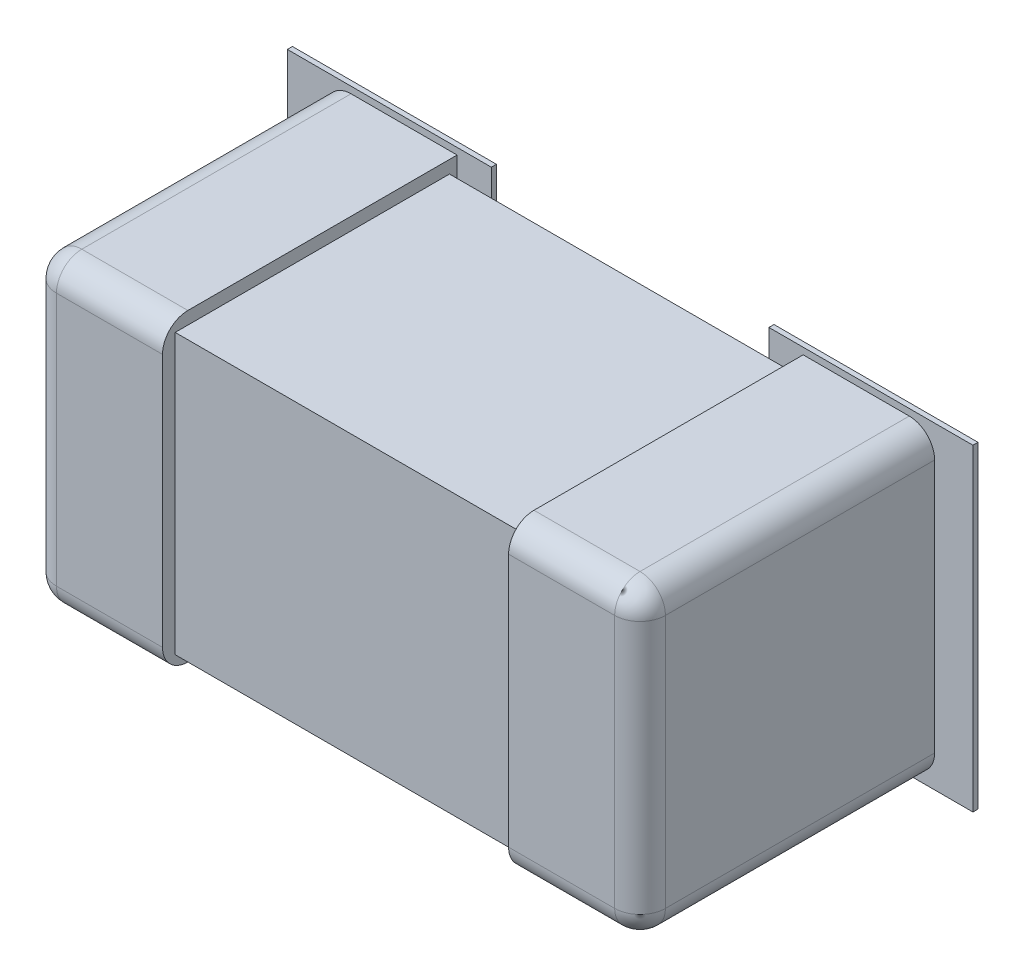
ISO-10303-21;
HEADER;
FILE_DESCRIPTION(('STEP AP214'),'2;1');
FILE_NAME('part.step','',(''),(''),'','','');
FILE_SCHEMA(('AUTOMOTIVE_DESIGN { 1 0 10303 214 1 1 1 1 }'));
ENDSEC;
DATA;
#1=APPLICATION_CONTEXT('core data for automotive mechanical design processes');
#2=APPLICATION_PROTOCOL_DEFINITION('international standard','automotive_design',2000,#1);
#3=PRODUCT_CONTEXT('',#1,'mechanical');
#4=PRODUCT('Part','Part','',(#3));
#5=PRODUCT_RELATED_PRODUCT_CATEGORY('part','',(#4));
#6=PRODUCT_DEFINITION_FORMATION('','',#4);
#7=PRODUCT_DEFINITION_CONTEXT('part definition',#1,'design');
#8=PRODUCT_DEFINITION('design','',#6,#7);
#9=PRODUCT_DEFINITION_SHAPE('','',#8);
#10=(LENGTH_UNIT() NAMED_UNIT(*) SI_UNIT(.MILLI.,.METRE.));
#11=(NAMED_UNIT(*) PLANE_ANGLE_UNIT() SI_UNIT($,.RADIAN.));
#12=(NAMED_UNIT(*) SI_UNIT($,.STERADIAN.) SOLID_ANGLE_UNIT());
#13=UNCERTAINTY_MEASURE_WITH_UNIT(LENGTH_MEASURE(1.E-05),#10,'distance_accuracy_value','');
#14=(GEOMETRIC_REPRESENTATION_CONTEXT(3) GLOBAL_UNCERTAINTY_ASSIGNED_CONTEXT((#13)) GLOBAL_UNIT_ASSIGNED_CONTEXT((#10,
#11,#12)) REPRESENTATION_CONTEXT('',''));
#15=CARTESIAN_POINT('',(0.,0.,0.));
#16=DIRECTION('',(0.,0.,1.));
#17=DIRECTION('',(1.,0.,0.));
#18=AXIS2_PLACEMENT_3D('',#15,#16,#17);
#19=CARTESIAN_POINT('',(0.,0.,0.0762));
#20=DIRECTION('',(0.,0.,1.));
#21=DIRECTION('',(1.,0.,0.));
#22=AXIS2_PLACEMENT_3D('',#19,#20,#21);
#23=PLANE('',#22);
#24=DIRECTION('',(1.,0.,0.));
#25=VECTOR('',#24,1.);
#26=CARTESIAN_POINT('',(0.138938,-0.159004,0.0762));
#27=LINE('',#26,#25);
#28=CARTESIAN_POINT('',(0.138938,-0.159004,0.0762));
#29=VERTEX_POINT('',#28);
#30=CARTESIAN_POINT('',(0.343154,-0.159004,0.0762));
#31=VERTEX_POINT('',#30);
#32=EDGE_CURVE('E330',#29,#31,#27,.T.);
#33=ORIENTED_EDGE('',*,*,#32,.F.);
#34=DIRECTION('',(0.,1.,0.));
#35=VECTOR('',#34,1.);
#36=CARTESIAN_POINT('',(0.138938,0.159004,0.0762));
#37=LINE('',#36,#35);
#38=CARTESIAN_POINT('',(0.138938,0.159004,0.0762));
#39=VERTEX_POINT('',#38);
#40=EDGE_CURVE('E335',#39,#29,#37,.F.);
#41=ORIENTED_EDGE('',*,*,#40,.F.);
#42=DIRECTION('',(1.,0.,0.));
#43=VECTOR('',#42,1.);
#44=CARTESIAN_POINT('',(0.343154,0.159004,0.0762));
#45=LINE('',#44,#43);
#46=CARTESIAN_POINT('',(0.343154,0.159004,0.0762));
#47=VERTEX_POINT('',#46);
#48=EDGE_CURVE('E319',#47,#39,#45,.F.);
#49=ORIENTED_EDGE('',*,*,#48,.F.);
#50=DIRECTION('',(0.,1.,0.));
#51=VECTOR('',#50,1.);
#52=CARTESIAN_POINT('',(0.343154,-0.159004,0.0762));
#53=LINE('',#52,#51);
#54=EDGE_CURVE('E95',#31,#47,#53,.T.);
#55=ORIENTED_EDGE('',*,*,#54,.F.);
#56=EDGE_LOOP('',(#33,#41,#49,#55));
#57=FACE_BOUND('',#56,.T.);
#58=ADVANCED_FACE('F16',(#57),#23,.F.);
#59=CARTESIAN_POINT('',(0.,0.,0.0762));
#60=DIRECTION('',(0.,0.,1.));
#61=DIRECTION('',(1.,0.,0.));
#62=AXIS2_PLACEMENT_3D('',#59,#60,#61);
#63=PLANE('',#62);
#64=DIRECTION('',(1.,0.,0.));
#65=VECTOR('',#64,1.);
#66=CARTESIAN_POINT('',(-0.138938,0.159004,0.0762));
#67=LINE('',#66,#65);
#68=CARTESIAN_POINT('',(-0.138938,0.159004,0.0762));
#69=VERTEX_POINT('',#68);
#70=CARTESIAN_POINT('',(-0.343154,0.159004,0.0762));
#71=VERTEX_POINT('',#70);
#72=EDGE_CURVE('E278',#69,#71,#67,.F.);
#73=ORIENTED_EDGE('',*,*,#72,.F.);
#74=DIRECTION('',(0.,1.,0.));
#75=VECTOR('',#74,1.);
#76=CARTESIAN_POINT('',(-0.138938,-0.159004,0.0762));
#77=LINE('',#76,#75);
#78=CARTESIAN_POINT('',(-0.138938,-0.159004,0.0762));
#79=VERTEX_POINT('',#78);
#80=EDGE_CURVE('E284',#79,#69,#77,.T.);
#81=ORIENTED_EDGE('',*,*,#80,.F.);
#82=DIRECTION('',(1.,0.,0.));
#83=VECTOR('',#82,1.);
#84=CARTESIAN_POINT('',(-0.343154,-0.159004,0.0762));
#85=LINE('',#84,#83);
#86=CARTESIAN_POINT('',(-0.343154,-0.159004,0.0762));
#87=VERTEX_POINT('',#86);
#88=EDGE_CURVE('E263',#87,#79,#85,.T.);
#89=ORIENTED_EDGE('',*,*,#88,.F.);
#90=DIRECTION('',(0.,1.,0.));
#91=VECTOR('',#90,1.);
#92=CARTESIAN_POINT('',(-0.343154,0.159004,0.0762));
#93=LINE('',#92,#91);
#94=EDGE_CURVE('E272',#71,#87,#93,.F.);
#95=ORIENTED_EDGE('',*,*,#94,.F.);
#96=EDGE_LOOP('',(#73,#81,#89,#95));
#97=FACE_BOUND('',#96,.T.);
#98=ADVANCED_FACE('F657',(#97),#63,.F.);
#99=CARTESIAN_POINT('',(0.138938,0.159004,0.0762));
#100=DIRECTION('',(-1.,0.,0.));
#101=DIRECTION('',(0.,0.,1.));
#102=AXIS2_PLACEMENT_3D('',#99,#100,#101);
#103=PLANE('',#102);
#104=DIRECTION('',(0.,0.,1.));
#105=VECTOR('',#104,1.);
#106=CARTESIAN_POINT('',(0.138938,0.159004,0.0762));
#107=LINE('',#106,#105);
#108=CARTESIAN_POINT('',(0.138938,0.159004,0.08128));
#109=VERTEX_POINT('',#108);
#110=EDGE_CURVE('E324',#39,#109,#107,.T.);
#111=ORIENTED_EDGE('',*,*,#110,.F.);
#112=ORIENTED_EDGE('',*,*,#40,.T.);
#113=DIRECTION('',(0.,0.,-1.));
#114=VECTOR('',#113,1.);
#115=CARTESIAN_POINT('',(0.138938,-0.159004,0.0762));
#116=LINE('',#115,#114);
#117=CARTESIAN_POINT('',(0.138938,-0.159004,0.08128));
#118=VERTEX_POINT('',#117);
#119=EDGE_CURVE('E332',#118,#29,#116,.T.);
#120=ORIENTED_EDGE('',*,*,#119,.F.);
#121=DIRECTION('',(0.,1.,0.));
#122=VECTOR('',#121,1.);
#123=CARTESIAN_POINT('',(0.138938,0.,0.08128));
#124=LINE('',#123,#122);
#125=EDGE_CURVE('E216',#109,#118,#124,.F.);
#126=ORIENTED_EDGE('',*,*,#125,.F.);
#127=EDGE_LOOP('',(#111,#112,#120,#126));
#128=FACE_BOUND('',#127,.T.);
#129=ADVANCED_FACE('F663',(#128),#103,.T.);
#130=CARTESIAN_POINT('',(0.138938,-0.159004,0.0762));
#131=DIRECTION('',(0.,-1.,0.));
#132=DIRECTION('',(0.,0.,-1.));
#133=AXIS2_PLACEMENT_3D('',#130,#131,#132);
#134=PLANE('',#133);
#135=ORIENTED_EDGE('',*,*,#119,.T.);
#136=ORIENTED_EDGE('',*,*,#32,.T.);
#137=DIRECTION('',(0.,0.,-1.));
#138=VECTOR('',#137,1.);
#139=CARTESIAN_POINT('',(0.343154,-0.159004,0.0762));
#140=LINE('',#139,#138);
#141=CARTESIAN_POINT('',(0.343154,-0.159004,0.08128));
#142=VERTEX_POINT('',#141);
#143=EDGE_CURVE('E328',#142,#31,#140,.T.);
#144=ORIENTED_EDGE('',*,*,#143,.F.);
#145=DIRECTION('',(1.,0.,0.));
#146=VECTOR('',#145,1.);
#147=CARTESIAN_POINT('',(0.,-0.159004,0.08128));
#148=LINE('',#147,#146);
#149=EDGE_CURVE('E213',#118,#142,#148,.T.);
#150=ORIENTED_EDGE('',*,*,#149,.F.);
#151=EDGE_LOOP('',(#135,#136,#144,#150));
#152=FACE_BOUND('',#151,.T.);
#153=ADVANCED_FACE('F708',(#152),#134,.T.);
#154=CARTESIAN_POINT('',(0.343154,-0.159004,0.0762));
#155=DIRECTION('',(1.,0.,0.));
#156=DIRECTION('',(0.,0.,-1.));
#157=AXIS2_PLACEMENT_3D('',#154,#155,#156);
#158=PLANE('',#157);
#159=ORIENTED_EDGE('',*,*,#143,.T.);
#160=ORIENTED_EDGE('',*,*,#54,.T.);
#161=DIRECTION('',(0.,0.,1.));
#162=VECTOR('',#161,1.);
#163=CARTESIAN_POINT('',(0.343154,0.159004,0.0762));
#164=LINE('',#163,#162);
#165=CARTESIAN_POINT('',(0.343154,0.159004,0.08128));
#166=VERTEX_POINT('',#165);
#167=EDGE_CURVE('E322',#166,#47,#164,.F.);
#168=ORIENTED_EDGE('',*,*,#167,.F.);
#169=DIRECTION('',(0.,1.,0.));
#170=VECTOR('',#169,1.);
#171=CARTESIAN_POINT('',(0.343154,0.,0.08128));
#172=LINE('',#171,#170);
#173=EDGE_CURVE('E210',#142,#166,#172,.T.);
#174=ORIENTED_EDGE('',*,*,#173,.F.);
#175=EDGE_LOOP('',(#159,#160,#168,#174));
#176=FACE_BOUND('',#175,.T.);
#177=ADVANCED_FACE('F715',(#176),#158,.T.);
#178=CARTESIAN_POINT('',(0.343154,0.159004,0.0762));
#179=DIRECTION('',(0.,1.,0.));
#180=DIRECTION('',(0.,0.,1.));
#181=AXIS2_PLACEMENT_3D('',#178,#179,#180);
#182=PLANE('',#181);
#183=ORIENTED_EDGE('',*,*,#167,.T.);
#184=ORIENTED_EDGE('',*,*,#48,.T.);
#185=ORIENTED_EDGE('',*,*,#110,.T.);
#186=DIRECTION('',(1.,0.,0.));
#187=VECTOR('',#186,1.);
#188=CARTESIAN_POINT('',(0.,0.159004,0.08128));
#189=LINE('',#188,#187);
#190=EDGE_CURVE('E207',#166,#109,#189,.F.);
#191=ORIENTED_EDGE('',*,*,#190,.F.);
#192=EDGE_LOOP('',(#183,#184,#185,#191));
#193=FACE_BOUND('',#192,.T.);
#194=ADVANCED_FACE('F723',(#193),#182,.T.);
#195=CARTESIAN_POINT('',(0.3048,-0.1524,0.0762));
#196=DIRECTION('',(1.,0.,0.));
#197=DIRECTION('',(0.,0.,-1.));
#198=AXIS2_PLACEMENT_3D('',#195,#196,#197);
#199=PLANE('',#198);
#200=DIRECTION('',(0.,0.,-1.));
#201=VECTOR('',#200,1.);
#202=CARTESIAN_POINT('',(0.3048,-0.127,0.7672201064));
#203=LINE('',#202,#201);
#204=CARTESIAN_POINT('',(0.3048,-0.127,0.08128));
#205=VERTEX_POINT('',#204);
#206=CARTESIAN_POINT('',(0.3048,-0.127,0.350774));
#207=VERTEX_POINT('',#206);
#208=EDGE_CURVE('E315',#205,#207,#203,.F.);
#209=ORIENTED_EDGE('',*,*,#208,.F.);
#210=DIRECTION('',(0.,1.,0.));
#211=VECTOR('',#210,1.);
#212=CARTESIAN_POINT('',(0.3048,0.,0.08128));
#213=LINE('',#212,#211);
#214=CARTESIAN_POINT('',(0.3048,0.127,0.08128));
#215=VERTEX_POINT('',#214);
#216=EDGE_CURVE('E205',#215,#205,#213,.F.);
#217=ORIENTED_EDGE('',*,*,#216,.F.);
#218=DIRECTION('',(0.,0.,-1.));
#219=VECTOR('',#218,1.);
#220=CARTESIAN_POINT('',(0.3048,0.127,0.7672201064));
#221=LINE('',#220,#219);
#222=CARTESIAN_POINT('',(0.3048,0.127,0.350774));
#223=VERTEX_POINT('',#222);
#224=EDGE_CURVE('E86',#223,#215,#221,.T.);
#225=ORIENTED_EDGE('',*,*,#224,.F.);
#226=DIRECTION('',(0.,1.,0.));
#227=VECTOR('',#226,1.);
#228=CARTESIAN_POINT('',(0.3048,-0.5735592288,0.350774));
#229=LINE('',#228,#227);
#230=EDGE_CURVE('E341',#207,#223,#229,.T.);
#231=ORIENTED_EDGE('',*,*,#230,.F.);
#232=EDGE_LOOP('',(#209,#217,#225,#231));
#233=FACE_BOUND('',#232,.T.);
#234=ADVANCED_FACE('F730',(#233),#199,.T.);
#235=CARTESIAN_POINT('',(0.2794,0.127,0.7672201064));
#236=DIRECTION('',(0.,0.,-1.));
#237=DIRECTION('',(-1.,0.,0.));
#238=AXIS2_PLACEMENT_3D('',#235,#236,#237);
#239=CYLINDRICAL_SURFACE('',#238,0.0254);
#240=ORIENTED_EDGE('',*,*,#224,.T.);
#241=CARTESIAN_POINT('',(0.2794,0.127,0.08128));
#242=DIRECTION('',(0.,0.,-1.));
#243=DIRECTION('',(-1.,0.,0.));
#244=AXIS2_PLACEMENT_3D('',#241,#242,#243);
#245=CIRCLE('',#244,0.0254);
#246=CARTESIAN_POINT('',(0.2794,0.1524,0.08128));
#247=VERTEX_POINT('',#246);
#248=EDGE_CURVE('E185',#247,#215,#245,.T.);
#249=ORIENTED_EDGE('',*,*,#248,.F.);
#250=DIRECTION('',(0.,0.,1.));
#251=VECTOR('',#250,1.);
#252=CARTESIAN_POINT('',(0.2794,0.1524,0.0762));
#253=LINE('',#252,#251);
#254=CARTESIAN_POINT('',(0.2794,0.1524,0.350774));
#255=VERTEX_POINT('',#254);
#256=EDGE_CURVE('E162',#255,#247,#253,.F.);
#257=ORIENTED_EDGE('',*,*,#256,.F.);
#258=CARTESIAN_POINT('',(0.2794,0.127,0.350774));
#259=DIRECTION('',(0.,0.,-1.));
#260=DIRECTION('',(-1.,0.,0.));
#261=AXIS2_PLACEMENT_3D('',#258,#259,#260);
#262=CIRCLE('',#261,0.0254);
#263=EDGE_CURVE('E19',#223,#255,#262,.F.);
#264=ORIENTED_EDGE('',*,*,#263,.F.);
#265=EDGE_LOOP('',(#240,#249,#257,#264));
#266=FACE_BOUND('',#265,.T.);
#267=ADVANCED_FACE('F183',(#266),#239,.T.);
#268=CARTESIAN_POINT('',(0.2794,0.127,0.350774));
#269=DIRECTION('',(0.,0.707106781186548,0.707106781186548));
#270=DIRECTION('',(1.,0.,0.));
#271=AXIS2_PLACEMENT_3D('',#268,#269,#270);
#272=SPHERICAL_SURFACE('',#271,0.0254);
#273=CARTESIAN_POINT('',(0.2794,0.127,0.350774));
#274=DIRECTION('',(-1.,0.,0.));
#275=DIRECTION('',(0.,0.,1.));
#276=AXIS2_PLACEMENT_3D('',#273,#274,#275);
#277=CIRCLE('',#276,0.0254);
#278=CARTESIAN_POINT('',(0.2794,0.127,0.376174));
#279=VERTEX_POINT('',#278);
#280=CARTESIAN_POINT('',(0.2794,0.144960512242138,0.368734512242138));
#281=VERTEX_POINT('',#280);
#282=EDGE_CURVE('E181',#279,#281,#277,.T.);
#283=ORIENTED_EDGE('',*,*,#282,.F.);
#284=CARTESIAN_POINT('',(0.2794,0.127,0.350774));
#285=DIRECTION('',(0.,1.,0.));
#286=DIRECTION('',(0.,0.,1.));
#287=AXIS2_PLACEMENT_3D('',#284,#285,#286);
#288=CIRCLE('',#287,0.0254);
#289=EDGE_CURVE('E172',#223,#279,#288,.F.);
#290=ORIENTED_EDGE('',*,*,#289,.F.);
#291=ORIENTED_EDGE('',*,*,#263,.T.);
#292=CARTESIAN_POINT('',(0.2794,0.127,0.350774));
#293=DIRECTION('',(-1.,0.,0.));
#294=DIRECTION('',(0.,0.,1.));
#295=AXIS2_PLACEMENT_3D('',#292,#293,#294);
#296=CIRCLE('',#295,0.0254);
#297=EDGE_CURVE('E171',#281,#255,#296,.T.);
#298=ORIENTED_EDGE('',*,*,#297,.F.);
#299=EDGE_LOOP('',(#283,#290,#291,#298));
#300=FACE_BOUND('',#299,.T.);
#301=ADVANCED_FACE('F170',(#300),#272,.T.);
#302=CARTESIAN_POINT('',(0.2794,-0.5735592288,0.350774));
#303=DIRECTION('',(0.,1.,0.));
#304=DIRECTION('',(0.,0.,1.));
#305=AXIS2_PLACEMENT_3D('',#302,#303,#304);
#306=CYLINDRICAL_SURFACE('',#305,0.0254);
#307=CARTESIAN_POINT('',(0.2794,-0.127,0.350774));
#308=DIRECTION('',(0.,1.,0.));
#309=DIRECTION('',(0.,0.,1.));
#310=AXIS2_PLACEMENT_3D('',#307,#308,#309);
#311=CIRCLE('',#310,0.0254);
#312=CARTESIAN_POINT('',(0.297360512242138,-0.127,0.368734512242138));
#313=VERTEX_POINT('',#312);
#314=EDGE_CURVE('E343',#207,#313,#311,.F.);
#315=ORIENTED_EDGE('',*,*,#314,.F.);
#316=ORIENTED_EDGE('',*,*,#230,.T.);
#317=ORIENTED_EDGE('',*,*,#289,.T.);
#318=DIRECTION('',(0.,1.,0.));
#319=VECTOR('',#318,1.);
#320=CARTESIAN_POINT('',(0.2794,0.,0.376174));
#321=LINE('',#320,#319);
#322=CARTESIAN_POINT('',(0.2794,-0.127,0.376174));
#323=VERTEX_POINT('',#322);
#324=EDGE_CURVE('E194',#323,#279,#321,.T.);
#325=ORIENTED_EDGE('',*,*,#324,.F.);
#326=CARTESIAN_POINT('',(0.2794,-0.127,0.350774));
#327=DIRECTION('',(0.,-1.,0.));
#328=DIRECTION('',(0.707106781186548,0.,0.707106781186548));
#329=AXIS2_PLACEMENT_3D('',#326,#327,#328);
#330=CIRCLE('',#329,0.0254);
#331=EDGE_CURVE('E295',#313,#323,#330,.T.);
#332=ORIENTED_EDGE('',*,*,#331,.F.);
#333=EDGE_LOOP('',(#315,#316,#317,#325,#332));
#334=FACE_BOUND('',#333,.T.);
#335=ADVANCED_FACE('F303',(#334),#306,.T.);
#336=CARTESIAN_POINT('',(0.2794,-0.127,0.350774));
#337=DIRECTION('',(0.707106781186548,0.,0.707106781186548));
#338=DIRECTION('',(0.,-1.,0.));
#339=AXIS2_PLACEMENT_3D('',#336,#337,#338);
#340=SPHERICAL_SURFACE('',#339,0.0254);
#341=ORIENTED_EDGE('',*,*,#331,.T.);
#342=CARTESIAN_POINT('',(0.2794,-0.127,0.350774));
#343=DIRECTION('',(1.,0.,0.));
#344=DIRECTION('',(0.,0.,-1.));
#345=AXIS2_PLACEMENT_3D('',#342,#343,#344);
#346=CIRCLE('',#345,0.0254);
#347=CARTESIAN_POINT('',(0.2794,-0.1524,0.350774));
#348=VERTEX_POINT('',#347);
#349=EDGE_CURVE('E373',#348,#323,#346,.F.);
#350=ORIENTED_EDGE('',*,*,#349,.F.);
#351=CARTESIAN_POINT('',(0.2794,-0.127,0.350774));
#352=DIRECTION('',(0.,0.,-1.));
#353=DIRECTION('',(-1.,0.,0.));
#354=AXIS2_PLACEMENT_3D('',#351,#352,#353);
#355=CIRCLE('',#354,0.0254);
#356=EDGE_CURVE('E287',#207,#348,#355,.T.);
#357=ORIENTED_EDGE('',*,*,#356,.F.);
#358=ORIENTED_EDGE('',*,*,#314,.T.);
#359=EDGE_LOOP('',(#341,#350,#357,#358));
#360=FACE_BOUND('',#359,.T.);
#361=ADVANCED_FACE('F298',(#360),#340,.T.);
#362=CARTESIAN_POINT('',(0.2794,-0.127,0.7672201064));
#363=DIRECTION('',(0.,0.,-1.));
#364=DIRECTION('',(-1.,0.,0.));
#365=AXIS2_PLACEMENT_3D('',#362,#363,#364);
#366=CYLINDRICAL_SURFACE('',#365,0.0254);
#367=DIRECTION('',(0.,0.,-1.));
#368=VECTOR('',#367,1.);
#369=CARTESIAN_POINT('',(0.2794,-0.1524,0.0762));
#370=LINE('',#369,#368);
#371=CARTESIAN_POINT('',(0.2794,-0.1524,0.08128));
#372=VERTEX_POINT('',#371);
#373=EDGE_CURVE('E288',#372,#348,#370,.F.);
#374=ORIENTED_EDGE('',*,*,#373,.F.);
#375=CARTESIAN_POINT('',(0.2794,-0.127,0.08128));
#376=DIRECTION('',(0.,0.,-1.));
#377=DIRECTION('',(-1.,0.,0.));
#378=AXIS2_PLACEMENT_3D('',#375,#376,#377);
#379=CIRCLE('',#378,0.0254);
#380=EDGE_CURVE('E188',#205,#372,#379,.T.);
#381=ORIENTED_EDGE('',*,*,#380,.F.);
#382=ORIENTED_EDGE('',*,*,#208,.T.);
#383=ORIENTED_EDGE('',*,*,#356,.T.);
#384=EDGE_LOOP('',(#374,#381,#382,#383));
#385=FACE_BOUND('',#384,.T.);
#386=ADVANCED_FACE('F302',(#385),#366,.T.);
#387=CARTESIAN_POINT('',(-0.138938,-0.159004,0.0762));
#388=DIRECTION('',(1.,0.,0.));
#389=DIRECTION('',(0.,0.,-1.));
#390=AXIS2_PLACEMENT_3D('',#387,#388,#389);
#391=PLANE('',#390);
#392=DIRECTION('',(0.,0.,-1.));
#393=VECTOR('',#392,1.);
#394=CARTESIAN_POINT('',(-0.138938,-0.159004,0.0762));
#395=LINE('',#394,#393);
#396=CARTESIAN_POINT('',(-0.138938,-0.159004,0.08128));
#397=VERTEX_POINT('',#396);
#398=EDGE_CURVE('E269',#79,#397,#395,.F.);
#399=ORIENTED_EDGE('',*,*,#398,.F.);
#400=ORIENTED_EDGE('',*,*,#80,.T.);
#401=DIRECTION('',(0.,0.,1.));
#402=VECTOR('',#401,1.);
#403=CARTESIAN_POINT('',(-0.138938,0.159004,0.0762));
#404=LINE('',#403,#402);
#405=CARTESIAN_POINT('',(-0.138938,0.159004,0.08128));
#406=VERTEX_POINT('',#405);
#407=EDGE_CURVE('E281',#406,#69,#404,.F.);
#408=ORIENTED_EDGE('',*,*,#407,.F.);
#409=DIRECTION('',(0.,1.,0.));
#410=VECTOR('',#409,1.);
#411=CARTESIAN_POINT('',(-0.138938,0.,0.08128));
#412=LINE('',#411,#410);
#413=EDGE_CURVE('E438',#397,#406,#412,.T.);
#414=ORIENTED_EDGE('',*,*,#413,.F.);
#415=EDGE_LOOP('',(#399,#400,#408,#414));
#416=FACE_BOUND('',#415,.T.);
#417=ADVANCED_FACE('F760',(#416),#391,.T.);
#418=CARTESIAN_POINT('',(-0.138938,0.159004,0.0762));
#419=DIRECTION('',(0.,1.,0.));
#420=DIRECTION('',(0.,0.,1.));
#421=AXIS2_PLACEMENT_3D('',#418,#419,#420);
#422=PLANE('',#421);
#423=ORIENTED_EDGE('',*,*,#407,.T.);
#424=ORIENTED_EDGE('',*,*,#72,.T.);
#425=DIRECTION('',(0.,0.,1.));
#426=VECTOR('',#425,1.);
#427=CARTESIAN_POINT('',(-0.343154,0.159004,0.0762));
#428=LINE('',#427,#426);
#429=CARTESIAN_POINT('',(-0.343154,0.159004,0.08128));
#430=VERTEX_POINT('',#429);
#431=EDGE_CURVE('E275',#430,#71,#428,.F.);
#432=ORIENTED_EDGE('',*,*,#431,.F.);
#433=DIRECTION('',(1.,0.,0.));
#434=VECTOR('',#433,1.);
#435=CARTESIAN_POINT('',(0.,0.159004,0.08128));
#436=LINE('',#435,#434);
#437=EDGE_CURVE('E435',#406,#430,#436,.F.);
#438=ORIENTED_EDGE('',*,*,#437,.F.);
#439=EDGE_LOOP('',(#423,#424,#432,#438));
#440=FACE_BOUND('',#439,.T.);
#441=ADVANCED_FACE('F766',(#440),#422,.T.);
#442=CARTESIAN_POINT('',(-0.343154,0.159004,0.0762));
#443=DIRECTION('',(-1.,0.,0.));
#444=DIRECTION('',(0.,0.,1.));
#445=AXIS2_PLACEMENT_3D('',#442,#443,#444);
#446=PLANE('',#445);
#447=ORIENTED_EDGE('',*,*,#431,.T.);
#448=ORIENTED_EDGE('',*,*,#94,.T.);
#449=DIRECTION('',(0.,0.,-1.));
#450=VECTOR('',#449,1.);
#451=CARTESIAN_POINT('',(-0.343154,-0.159004,0.0762));
#452=LINE('',#451,#450);
#453=CARTESIAN_POINT('',(-0.343154,-0.159004,0.08128));
#454=VERTEX_POINT('',#453);
#455=EDGE_CURVE('E266',#454,#87,#452,.T.);
#456=ORIENTED_EDGE('',*,*,#455,.F.);
#457=DIRECTION('',(0.,1.,0.));
#458=VECTOR('',#457,1.);
#459=CARTESIAN_POINT('',(-0.343154,0.,0.08128));
#460=LINE('',#459,#458);
#461=EDGE_CURVE('E432',#430,#454,#460,.F.);
#462=ORIENTED_EDGE('',*,*,#461,.F.);
#463=EDGE_LOOP('',(#447,#448,#456,#462));
#464=FACE_BOUND('',#463,.T.);
#465=ADVANCED_FACE('F773',(#464),#446,.T.);
#466=CARTESIAN_POINT('',(-0.343154,-0.159004,0.0762));
#467=DIRECTION('',(0.,-1.,0.));
#468=DIRECTION('',(0.,0.,-1.));
#469=AXIS2_PLACEMENT_3D('',#466,#467,#468);
#470=PLANE('',#469);
#471=ORIENTED_EDGE('',*,*,#455,.T.);
#472=ORIENTED_EDGE('',*,*,#88,.T.);
#473=ORIENTED_EDGE('',*,*,#398,.T.);
#474=DIRECTION('',(1.,0.,0.));
#475=VECTOR('',#474,1.);
#476=CARTESIAN_POINT('',(0.,-0.159004,0.08128));
#477=LINE('',#476,#475);
#478=EDGE_CURVE('E372',#454,#397,#477,.T.);
#479=ORIENTED_EDGE('',*,*,#478,.F.);
#480=EDGE_LOOP('',(#471,#472,#473,#479));
#481=FACE_BOUND('',#480,.T.);
#482=ADVANCED_FACE('F781',(#481),#470,.T.);
#483=CARTESIAN_POINT('',(-0.3048,0.1524,0.0762));
#484=DIRECTION('',(-1.,0.,0.));
#485=DIRECTION('',(0.,0.,1.));
#486=AXIS2_PLACEMENT_3D('',#483,#484,#485);
#487=PLANE('',#486);
#488=DIRECTION('',(0.,0.,-1.));
#489=VECTOR('',#488,1.);
#490=CARTESIAN_POINT('',(-0.3048,0.127,0.7672201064));
#491=LINE('',#490,#489);
#492=CARTESIAN_POINT('',(-0.3048,0.127,0.08128));
#493=VERTEX_POINT('',#492);
#494=CARTESIAN_POINT('',(-0.3048,0.127,0.350774));
#495=VERTEX_POINT('',#494);
#496=EDGE_CURVE('E226',#493,#495,#491,.F.);
#497=ORIENTED_EDGE('',*,*,#496,.F.);
#498=DIRECTION('',(0.,1.,0.));
#499=VECTOR('',#498,1.);
#500=CARTESIAN_POINT('',(-0.3048,0.,0.08128));
#501=LINE('',#500,#499);
#502=CARTESIAN_POINT('',(-0.3048,-0.127,0.08128));
#503=VERTEX_POINT('',#502);
#504=EDGE_CURVE('E368',#503,#493,#501,.T.);
#505=ORIENTED_EDGE('',*,*,#504,.F.);
#506=DIRECTION('',(0.,0.,-1.));
#507=VECTOR('',#506,1.);
#508=CARTESIAN_POINT('',(-0.3048,-0.127,0.7672201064));
#509=LINE('',#508,#507);
#510=CARTESIAN_POINT('',(-0.3048,-0.127,0.350774));
#511=VERTEX_POINT('',#510);
#512=EDGE_CURVE('E260',#511,#503,#509,.T.);
#513=ORIENTED_EDGE('',*,*,#512,.F.);
#514=DIRECTION('',(0.,-1.,0.));
#515=VECTOR('',#514,1.);
#516=CARTESIAN_POINT('',(-0.3048,0.5735592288,0.350774));
#517=LINE('',#516,#515);
#518=EDGE_CURVE('E337',#495,#511,#517,.T.);
#519=ORIENTED_EDGE('',*,*,#518,.F.);
#520=EDGE_LOOP('',(#497,#505,#513,#519));
#521=FACE_BOUND('',#520,.T.);
#522=ADVANCED_FACE('F789',(#521),#487,.T.);
#523=CARTESIAN_POINT('',(-0.2794,-0.127,0.7672201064));
#524=DIRECTION('',(0.,0.,-1.));
#525=DIRECTION('',(-1.,0.,0.));
#526=AXIS2_PLACEMENT_3D('',#523,#524,#525);
#527=CYLINDRICAL_SURFACE('',#526,0.0254);
#528=ORIENTED_EDGE('',*,*,#512,.T.);
#529=CARTESIAN_POINT('',(-0.2794,-0.127,0.08128));
#530=DIRECTION('',(0.,0.,-1.));
#531=DIRECTION('',(-1.,0.,0.));
#532=AXIS2_PLACEMENT_3D('',#529,#530,#531);
#533=CIRCLE('',#532,0.0254);
#534=CARTESIAN_POINT('',(-0.2794,-0.1524,0.08128));
#535=VERTEX_POINT('',#534);
#536=EDGE_CURVE('E369',#535,#503,#533,.T.);
#537=ORIENTED_EDGE('',*,*,#536,.F.);
#538=DIRECTION('',(0.,0.,-1.));
#539=VECTOR('',#538,1.);
#540=CARTESIAN_POINT('',(-0.2794,-0.1524,0.0762));
#541=LINE('',#540,#539);
#542=CARTESIAN_POINT('',(-0.2794,-0.1524,0.350774));
#543=VERTEX_POINT('',#542);
#544=EDGE_CURVE('E257',#543,#535,#541,.T.);
#545=ORIENTED_EDGE('',*,*,#544,.F.);
#546=CARTESIAN_POINT('',(-0.2794,-0.127,0.350774));
#547=DIRECTION('',(0.,0.,-1.));
#548=DIRECTION('',(-1.,0.,0.));
#549=AXIS2_PLACEMENT_3D('',#546,#547,#548);
#550=CIRCLE('',#549,0.0254);
#551=EDGE_CURVE('E262',#511,#543,#550,.F.);
#552=ORIENTED_EDGE('',*,*,#551,.F.);
#553=EDGE_LOOP('',(#528,#537,#545,#552));
#554=FACE_BOUND('',#553,.T.);
#555=ADVANCED_FACE('F252',(#554),#527,.T.);
#556=CARTESIAN_POINT('',(-0.2794,-0.127,0.350774));
#557=DIRECTION('',(0.,-0.707106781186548,0.707106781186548));
#558=DIRECTION('',(-1.,0.,0.));
#559=AXIS2_PLACEMENT_3D('',#556,#557,#558);
#560=SPHERICAL_SURFACE('',#559,0.0254);
#561=CARTESIAN_POINT('',(-0.2794,-0.127,0.350774));
#562=DIRECTION('',(1.,0.,0.));
#563=DIRECTION('',(0.,0.,-1.));
#564=AXIS2_PLACEMENT_3D('',#561,#562,#563);
#565=CIRCLE('',#564,0.0254);
#566=CARTESIAN_POINT('',(-0.2794,-0.127,0.376174));
#567=VERTEX_POINT('',#566);
#568=CARTESIAN_POINT('',(-0.2794,-0.144960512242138,0.368734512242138));
#569=VERTEX_POINT('',#568);
#570=EDGE_CURVE('E234',#567,#569,#565,.T.);
#571=ORIENTED_EDGE('',*,*,#570,.F.);
#572=CARTESIAN_POINT('',(-0.2794,-0.127,0.350774));
#573=DIRECTION('',(0.,-1.,0.));
#574=DIRECTION('',(0.,0.,-1.));
#575=AXIS2_PLACEMENT_3D('',#572,#573,#574);
#576=CIRCLE('',#575,0.0254);
#577=EDGE_CURVE('E340',#511,#567,#576,.F.);
#578=ORIENTED_EDGE('',*,*,#577,.F.);
#579=ORIENTED_EDGE('',*,*,#551,.T.);
#580=CARTESIAN_POINT('',(-0.2794,-0.127,0.350774));
#581=DIRECTION('',(1.,0.,0.));
#582=DIRECTION('',(0.,0.,-1.));
#583=AXIS2_PLACEMENT_3D('',#580,#581,#582);
#584=CIRCLE('',#583,0.0254);
#585=EDGE_CURVE('E363',#569,#543,#584,.T.);
#586=ORIENTED_EDGE('',*,*,#585,.F.);
#587=EDGE_LOOP('',(#571,#578,#579,#586));
#588=FACE_BOUND('',#587,.T.);
#589=ADVANCED_FACE('F247',(#588),#560,.T.);
#590=CARTESIAN_POINT('',(-0.2794,0.5735592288,0.350774));
#591=DIRECTION('',(0.,-1.,0.));
#592=DIRECTION('',(0.,0.,-1.));
#593=AXIS2_PLACEMENT_3D('',#590,#591,#592);
#594=CYLINDRICAL_SURFACE('',#593,0.0254);
#595=CARTESIAN_POINT('',(-0.2794,0.127,0.350774));
#596=DIRECTION('',(0.,-1.,0.));
#597=DIRECTION('',(0.,0.,-1.));
#598=AXIS2_PLACEMENT_3D('',#595,#596,#597);
#599=CIRCLE('',#598,0.0254);
#600=CARTESIAN_POINT('',(-0.2794,0.127,0.376174));
#601=VERTEX_POINT('',#600);
#602=EDGE_CURVE('E259',#495,#601,#599,.F.);
#603=ORIENTED_EDGE('',*,*,#602,.F.);
#604=ORIENTED_EDGE('',*,*,#518,.T.);
#605=ORIENTED_EDGE('',*,*,#577,.T.);
#606=DIRECTION('',(0.,1.,0.));
#607=VECTOR('',#606,1.);
#608=CARTESIAN_POINT('',(-0.2794,0.,0.376174));
#609=LINE('',#608,#607);
#610=EDGE_CURVE('E227',#601,#567,#609,.F.);
#611=ORIENTED_EDGE('',*,*,#610,.F.);
#612=EDGE_LOOP('',(#603,#604,#605,#611));
#613=FACE_BOUND('',#612,.T.);
#614=ADVANCED_FACE('F242',(#613),#594,.T.);
#615=CARTESIAN_POINT('',(-0.2794,0.127,0.350774));
#616=DIRECTION('',(-0.707106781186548,0.707106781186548,0.));
#617=DIRECTION('',(0.,0.,1.));
#618=AXIS2_PLACEMENT_3D('',#615,#616,#617);
#619=SPHERICAL_SURFACE('',#618,0.0254);
#620=ORIENTED_EDGE('',*,*,#602,.T.);
#621=CARTESIAN_POINT('',(-0.2794,0.127,0.350774));
#622=DIRECTION('',(-1.,0.,0.));
#623=DIRECTION('',(0.,0.,1.));
#624=AXIS2_PLACEMENT_3D('',#621,#622,#623);
#625=CIRCLE('',#624,0.0254);
#626=CARTESIAN_POINT('',(-0.2794,0.1524,0.350774));
#627=VERTEX_POINT('',#626);
#628=EDGE_CURVE('E360',#627,#601,#625,.F.);
#629=ORIENTED_EDGE('',*,*,#628,.F.);
#630=CARTESIAN_POINT('',(-0.2794,0.127,0.350774));
#631=DIRECTION('',(0.,0.,-1.));
#632=DIRECTION('',(-1.,0.,0.));
#633=AXIS2_PLACEMENT_3D('',#630,#631,#632);
#634=CIRCLE('',#633,0.0254);
#635=CARTESIAN_POINT('',(-0.297360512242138,0.144960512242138,0.350774));
#636=VERTEX_POINT('',#635);
#637=EDGE_CURVE('E219',#636,#627,#634,.T.);
#638=ORIENTED_EDGE('',*,*,#637,.F.);
#639=CARTESIAN_POINT('',(-0.2794,0.127,0.350774));
#640=DIRECTION('',(0.,0.,-1.));
#641=DIRECTION('',(-1.,0.,0.));
#642=AXIS2_PLACEMENT_3D('',#639,#640,#641);
#643=CIRCLE('',#642,0.0254);
#644=EDGE_CURVE('E34',#495,#636,#643,.T.);
#645=ORIENTED_EDGE('',*,*,#644,.F.);
#646=EDGE_LOOP('',(#620,#629,#638,#645));
#647=FACE_BOUND('',#646,.T.);
#648=ADVANCED_FACE('F237',(#647),#619,.T.);
#649=CARTESIAN_POINT('',(-0.2794,0.127,0.7672201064));
#650=DIRECTION('',(0.,0.,-1.));
#651=DIRECTION('',(-1.,0.,0.));
#652=AXIS2_PLACEMENT_3D('',#649,#650,#651);
#653=CYLINDRICAL_SURFACE('',#652,0.0254);
#654=DIRECTION('',(0.,0.,1.));
#655=VECTOR('',#654,1.);
#656=CARTESIAN_POINT('',(-0.2794,0.1524,0.0762));
#657=LINE('',#656,#655);
#658=CARTESIAN_POINT('',(-0.2794,0.1524,0.08128));
#659=VERTEX_POINT('',#658);
#660=EDGE_CURVE('E220',#659,#627,#657,.T.);
#661=ORIENTED_EDGE('',*,*,#660,.F.);
#662=CARTESIAN_POINT('',(-0.2794,0.127,0.08128));
#663=DIRECTION('',(0.,0.,-1.));
#664=DIRECTION('',(-1.,0.,0.));
#665=AXIS2_PLACEMENT_3D('',#662,#663,#664);
#666=CIRCLE('',#665,0.0254);
#667=EDGE_CURVE('E366',#493,#659,#666,.T.);
#668=ORIENTED_EDGE('',*,*,#667,.F.);
#669=ORIENTED_EDGE('',*,*,#496,.T.);
#670=ORIENTED_EDGE('',*,*,#644,.T.);
#671=ORIENTED_EDGE('',*,*,#637,.T.);
#672=EDGE_LOOP('',(#661,#668,#669,#670,#671));
#673=FACE_BOUND('',#672,.T.);
#674=ADVANCED_FACE('F241',(#673),#653,.T.);
#675=CARTESIAN_POINT('',(0.,0.,0.08128));
#676=DIRECTION('',(0.,0.,1.));
#677=DIRECTION('',(1.,0.,0.));
#678=AXIS2_PLACEMENT_3D('',#675,#676,#677);
#679=PLANE('',#678);
#680=DIRECTION('',(0.,1.,0.));
#681=VECTOR('',#680,1.);
#682=CARTESIAN_POINT('',(0.173228,-0.1524,0.08128));
#683=LINE('',#682,#681);
#684=CARTESIAN_POINT('',(0.173228,-0.1524,0.08128));
#685=VERTEX_POINT('',#684);
#686=CARTESIAN_POINT('',(0.173228,0.1524,0.08128));
#687=VERTEX_POINT('',#686);
#688=EDGE_CURVE('E403',#685,#687,#683,.T.);
#689=ORIENTED_EDGE('',*,*,#688,.T.);
#690=DIRECTION('',(1.,0.,0.));
#691=VECTOR('',#690,1.);
#692=CARTESIAN_POINT('',(0.3048,0.1524,0.08128));
#693=LINE('',#692,#691);
#694=EDGE_CURVE('E187',#247,#687,#693,.F.);
#695=ORIENTED_EDGE('',*,*,#694,.F.);
#696=ORIENTED_EDGE('',*,*,#248,.T.);
#697=ORIENTED_EDGE('',*,*,#216,.T.);
#698=ORIENTED_EDGE('',*,*,#380,.T.);
#699=DIRECTION('',(1.,0.,0.));
#700=VECTOR('',#699,1.);
#701=CARTESIAN_POINT('',(-0.3048,-0.1524,0.08128));
#702=LINE('',#701,#700);
#703=EDGE_CURVE('E441',#685,#372,#702,.T.);
#704=ORIENTED_EDGE('',*,*,#703,.F.);
#705=EDGE_LOOP('',(#689,#695,#696,#697,#698,#704));
#706=FACE_BOUND('',#705,.T.);
#707=ORIENTED_EDGE('',*,*,#173,.T.);
#708=ORIENTED_EDGE('',*,*,#190,.T.);
#709=ORIENTED_EDGE('',*,*,#125,.T.);
#710=ORIENTED_EDGE('',*,*,#149,.T.);
#711=EDGE_LOOP('',(#707,#708,#709,#710));
#712=FACE_BOUND('',#711,.T.);
#713=ADVANCED_FACE('F463',(#706,#712),#679,.T.);
#714=CARTESIAN_POINT('',(0.3048,0.1524,0.0762));
#715=DIRECTION('',(0.,1.,0.));
#716=DIRECTION('',(0.,0.,1.));
#717=AXIS2_PLACEMENT_3D('',#714,#715,#716);
#718=PLANE('',#717);
#719=ORIENTED_EDGE('',*,*,#256,.T.);
#720=ORIENTED_EDGE('',*,*,#694,.T.);
#721=DIRECTION('',(0.,0.,-1.));
#722=VECTOR('',#721,1.);
#723=CARTESIAN_POINT('',(0.173228,0.1524,0.0889));
#724=LINE('',#723,#722);
#725=CARTESIAN_POINT('',(0.173228,0.1524,0.350774));
#726=VERTEX_POINT('',#725);
#727=EDGE_CURVE('E193',#687,#726,#724,.F.);
#728=ORIENTED_EDGE('',*,*,#727,.T.);
#729=DIRECTION('',(-1.,0.,0.));
#730=VECTOR('',#729,1.);
#731=CARTESIAN_POINT('',(1.2378251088,0.1524,0.350774));
#732=LINE('',#731,#730);
#733=EDGE_CURVE('E178',#255,#726,#732,.T.);
#734=ORIENTED_EDGE('',*,*,#733,.F.);
#735=EDGE_LOOP('',(#719,#720,#728,#734));
#736=FACE_BOUND('',#735,.T.);
#737=ADVANCED_FACE('F191',(#736),#718,.T.);
#738=CARTESIAN_POINT('',(1.2378251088,0.127,0.350774));
#739=DIRECTION('',(-1.,0.,0.));
#740=DIRECTION('',(0.,0.,1.));
#741=AXIS2_PLACEMENT_3D('',#738,#739,#740);
#742=CYLINDRICAL_SURFACE('',#741,0.0254);
#743=ORIENTED_EDGE('',*,*,#733,.T.);
#744=CARTESIAN_POINT('',(0.173228,0.127,0.350774));
#745=DIRECTION('',(-1.,0.,0.));
#746=DIRECTION('',(0.,0.,1.));
#747=AXIS2_PLACEMENT_3D('',#744,#745,#746);
#748=CIRCLE('',#747,0.0254);
#749=CARTESIAN_POINT('',(0.173228,0.127,0.376174));
#750=VERTEX_POINT('',#749);
#751=EDGE_CURVE('E358',#726,#750,#748,.F.);
#752=ORIENTED_EDGE('',*,*,#751,.T.);
#753=DIRECTION('',(1.,0.,0.));
#754=VECTOR('',#753,1.);
#755=CARTESIAN_POINT('',(0.,0.127,0.376174));
#756=LINE('',#755,#754);
#757=EDGE_CURVE('E197',#279,#750,#756,.F.);
#758=ORIENTED_EDGE('',*,*,#757,.F.);
#759=ORIENTED_EDGE('',*,*,#282,.T.);
#760=ORIENTED_EDGE('',*,*,#297,.T.);
#761=EDGE_LOOP('',(#743,#752,#758,#759,#760));
#762=FACE_BOUND('',#761,.T.);
#763=ADVANCED_FACE('F176',(#762),#742,.T.);
#764=CARTESIAN_POINT('',(0.,0.,0.376174));
#765=DIRECTION('',(0.,0.,1.));
#766=DIRECTION('',(1.,0.,0.));
#767=AXIS2_PLACEMENT_3D('',#764,#765,#766);
#768=PLANE('',#767);
#769=ORIENTED_EDGE('',*,*,#324,.T.);
#770=ORIENTED_EDGE('',*,*,#757,.T.);
#771=DIRECTION('',(0.,1.,0.));
#772=VECTOR('',#771,1.);
#773=CARTESIAN_POINT('',(0.173228,-0.1524,0.376174));
#774=LINE('',#773,#772);
#775=CARTESIAN_POINT('',(0.173228,-0.127,0.376174));
#776=VERTEX_POINT('',#775);
#777=EDGE_CURVE('E357',#750,#776,#774,.F.);
#778=ORIENTED_EDGE('',*,*,#777,.T.);
#779=DIRECTION('',(1.,0.,0.));
#780=VECTOR('',#779,1.);
#781=CARTESIAN_POINT('',(-1.2378251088,-0.127,0.376174));
#782=LINE('',#781,#780);
#783=EDGE_CURVE('E291',#323,#776,#782,.F.);
#784=ORIENTED_EDGE('',*,*,#783,.F.);
#785=EDGE_LOOP('',(#769,#770,#778,#784));
#786=FACE_BOUND('',#785,.T.);
#787=ADVANCED_FACE('F388',(#786),#768,.T.);
#788=CARTESIAN_POINT('',(-1.2378251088,-0.127,0.350774));
#789=DIRECTION('',(1.,0.,0.));
#790=DIRECTION('',(0.,0.,-1.));
#791=AXIS2_PLACEMENT_3D('',#788,#789,#790);
#792=CYLINDRICAL_SURFACE('',#791,0.0254);
#793=ORIENTED_EDGE('',*,*,#783,.T.);
#794=CARTESIAN_POINT('',(0.173228,-0.127,0.350774));
#795=DIRECTION('',(1.,0.,0.));
#796=DIRECTION('',(0.,0.,-1.));
#797=AXIS2_PLACEMENT_3D('',#794,#795,#796);
#798=CIRCLE('',#797,0.0254);
#799=CARTESIAN_POINT('',(0.173228,-0.1524,0.350774));
#800=VERTEX_POINT('',#799);
#801=EDGE_CURVE('E353',#776,#800,#798,.T.);
#802=ORIENTED_EDGE('',*,*,#801,.T.);
#803=DIRECTION('',(1.,0.,0.));
#804=VECTOR('',#803,1.);
#805=CARTESIAN_POINT('',(-0.3048,-0.1524,0.350774));
#806=LINE('',#805,#804);
#807=EDGE_CURVE('E290',#348,#800,#806,.F.);
#808=ORIENTED_EDGE('',*,*,#807,.F.);
#809=ORIENTED_EDGE('',*,*,#349,.T.);
#810=EDGE_LOOP('',(#793,#802,#808,#809));
#811=FACE_BOUND('',#810,.T.);
#812=ADVANCED_FACE('F450',(#811),#792,.T.);
#813=CARTESIAN_POINT('',(-0.3048,-0.1524,0.0762));
#814=DIRECTION('',(0.,-1.,0.));
#815=DIRECTION('',(0.,0.,-1.));
#816=AXIS2_PLACEMENT_3D('',#813,#814,#815);
#817=PLANE('',#816);
#818=DIRECTION('',(0.,0.,-1.));
#819=VECTOR('',#818,1.);
#820=CARTESIAN_POINT('',(0.173228,-0.1524,0.0889));
#821=LINE('',#820,#819);
#822=EDGE_CURVE('E356',#800,#685,#821,.T.);
#823=ORIENTED_EDGE('',*,*,#822,.T.);
#824=ORIENTED_EDGE('',*,*,#703,.T.);
#825=ORIENTED_EDGE('',*,*,#373,.T.);
#826=ORIENTED_EDGE('',*,*,#807,.T.);
#827=EDGE_LOOP('',(#823,#824,#825,#826));
#828=FACE_BOUND('',#827,.T.);
#829=ADVANCED_FACE('F460',(#828),#817,.T.);
#830=CARTESIAN_POINT('',(0.,0.,0.08128));
#831=DIRECTION('',(0.,0.,1.));
#832=DIRECTION('',(1.,0.,0.));
#833=AXIS2_PLACEMENT_3D('',#830,#831,#832);
#834=PLANE('',#833);
#835=DIRECTION('',(0.,1.,0.));
#836=VECTOR('',#835,1.);
#837=CARTESIAN_POINT('',(-0.173228,-0.1524,0.08128));
#838=LINE('',#837,#836);
#839=CARTESIAN_POINT('',(-0.173228,0.1524,0.08128));
#840=VERTEX_POINT('',#839);
#841=CARTESIAN_POINT('',(-0.173228,-0.1524,0.08128));
#842=VERTEX_POINT('',#841);
#843=EDGE_CURVE('E415',#840,#842,#838,.F.);
#844=ORIENTED_EDGE('',*,*,#843,.T.);
#845=DIRECTION('',(1.,0.,0.));
#846=VECTOR('',#845,1.);
#847=CARTESIAN_POINT('',(-0.3048,-0.1524,0.08128));
#848=LINE('',#847,#846);
#849=EDGE_CURVE('E424',#535,#842,#848,.T.);
#850=ORIENTED_EDGE('',*,*,#849,.F.);
#851=ORIENTED_EDGE('',*,*,#536,.T.);
#852=ORIENTED_EDGE('',*,*,#504,.T.);
#853=ORIENTED_EDGE('',*,*,#667,.T.);
#854=DIRECTION('',(1.,0.,0.));
#855=VECTOR('',#854,1.);
#856=CARTESIAN_POINT('',(0.3048,0.1524,0.08128));
#857=LINE('',#856,#855);
#858=EDGE_CURVE('E409',#840,#659,#857,.F.);
#859=ORIENTED_EDGE('',*,*,#858,.F.);
#860=EDGE_LOOP('',(#844,#850,#851,#852,#853,#859));
#861=FACE_BOUND('',#860,.T.);
#862=ORIENTED_EDGE('',*,*,#461,.T.);
#863=ORIENTED_EDGE('',*,*,#478,.T.);
#864=ORIENTED_EDGE('',*,*,#413,.T.);
#865=ORIENTED_EDGE('',*,*,#437,.T.);
#866=EDGE_LOOP('',(#862,#863,#864,#865));
#867=FACE_BOUND('',#866,.T.);
#868=ADVANCED_FACE('F629',(#861,#867),#834,.T.);
#869=CARTESIAN_POINT('',(-0.3048,-0.1524,0.0762));
#870=DIRECTION('',(0.,-1.,0.));
#871=DIRECTION('',(0.,0.,-1.));
#872=AXIS2_PLACEMENT_3D('',#869,#870,#871);
#873=PLANE('',#872);
#874=ORIENTED_EDGE('',*,*,#544,.T.);
#875=ORIENTED_EDGE('',*,*,#849,.T.);
#876=DIRECTION('',(0.,0.,1.));
#877=VECTOR('',#876,1.);
#878=CARTESIAN_POINT('',(-0.173228,-0.1524,0.0762));
#879=LINE('',#878,#877);
#880=CARTESIAN_POINT('',(-0.173228,-0.1524,0.350774));
#881=VERTEX_POINT('',#880);
#882=EDGE_CURVE('E352',#842,#881,#879,.T.);
#883=ORIENTED_EDGE('',*,*,#882,.T.);
#884=DIRECTION('',(1.,0.,0.));
#885=VECTOR('',#884,1.);
#886=CARTESIAN_POINT('',(-1.2378251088,-0.1524,0.350774));
#887=LINE('',#886,#885);
#888=EDGE_CURVE('E231',#543,#881,#887,.T.);
#889=ORIENTED_EDGE('',*,*,#888,.F.);
#890=EDGE_LOOP('',(#874,#875,#883,#889));
#891=FACE_BOUND('',#890,.T.);
#892=ADVANCED_FACE('F635',(#891),#873,.T.);
#893=CARTESIAN_POINT('',(-1.2378251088,-0.127,0.350774));
#894=DIRECTION('',(1.,0.,0.));
#895=DIRECTION('',(0.,0.,-1.));
#896=AXIS2_PLACEMENT_3D('',#893,#894,#895);
#897=CYLINDRICAL_SURFACE('',#896,0.0254);
#898=ORIENTED_EDGE('',*,*,#888,.T.);
#899=CARTESIAN_POINT('',(-0.173228,-0.127,0.350774));
#900=DIRECTION('',(1.,0.,0.));
#901=DIRECTION('',(0.,0.,-1.));
#902=AXIS2_PLACEMENT_3D('',#899,#900,#901);
#903=CIRCLE('',#902,0.0254);
#904=CARTESIAN_POINT('',(-0.173228,-0.127,0.376174));
#905=VERTEX_POINT('',#904);
#906=EDGE_CURVE('E349',#881,#905,#903,.F.);
#907=ORIENTED_EDGE('',*,*,#906,.T.);
#908=DIRECTION('',(1.,0.,0.));
#909=VECTOR('',#908,1.);
#910=CARTESIAN_POINT('',(0.,-0.127,0.376174));
#911=LINE('',#910,#909);
#912=EDGE_CURVE('E230',#567,#905,#911,.T.);
#913=ORIENTED_EDGE('',*,*,#912,.F.);
#914=ORIENTED_EDGE('',*,*,#570,.T.);
#915=ORIENTED_EDGE('',*,*,#585,.T.);
#916=EDGE_LOOP('',(#898,#907,#913,#914,#915));
#917=FACE_BOUND('',#916,.T.);
#918=ADVANCED_FACE('F851',(#917),#897,.T.);
#919=CARTESIAN_POINT('',(0.,0.,0.376174));
#920=DIRECTION('',(0.,0.,1.));
#921=DIRECTION('',(1.,0.,0.));
#922=AXIS2_PLACEMENT_3D('',#919,#920,#921);
#923=PLANE('',#922);
#924=ORIENTED_EDGE('',*,*,#610,.T.);
#925=ORIENTED_EDGE('',*,*,#912,.T.);
#926=DIRECTION('',(0.,1.,0.));
#927=VECTOR('',#926,1.);
#928=CARTESIAN_POINT('',(-0.173228,-0.1524,0.376174));
#929=LINE('',#928,#927);
#930=CARTESIAN_POINT('',(-0.173228,0.127,0.376174));
#931=VERTEX_POINT('',#930);
#932=EDGE_CURVE('E348',#905,#931,#929,.T.);
#933=ORIENTED_EDGE('',*,*,#932,.T.);
#934=DIRECTION('',(-1.,0.,0.));
#935=VECTOR('',#934,1.);
#936=CARTESIAN_POINT('',(1.2378251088,0.127,0.376174));
#937=LINE('',#936,#935);
#938=EDGE_CURVE('E224',#601,#931,#937,.F.);
#939=ORIENTED_EDGE('',*,*,#938,.F.);
#940=EDGE_LOOP('',(#924,#925,#933,#939));
#941=FACE_BOUND('',#940,.T.);
#942=ADVANCED_FACE('F858',(#941),#923,.T.);
#943=CARTESIAN_POINT('',(1.2378251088,0.127,0.350774));
#944=DIRECTION('',(-1.,0.,0.));
#945=DIRECTION('',(0.,0.,1.));
#946=AXIS2_PLACEMENT_3D('',#943,#944,#945);
#947=CYLINDRICAL_SURFACE('',#946,0.0254);
#948=ORIENTED_EDGE('',*,*,#938,.T.);
#949=CARTESIAN_POINT('',(-0.173228,0.127,0.350774));
#950=DIRECTION('',(-1.,0.,0.));
#951=DIRECTION('',(0.,0.,1.));
#952=AXIS2_PLACEMENT_3D('',#949,#950,#951);
#953=CIRCLE('',#952,0.0254);
#954=CARTESIAN_POINT('',(-0.173228,0.1524,0.350774));
#955=VERTEX_POINT('',#954);
#956=EDGE_CURVE('E344',#931,#955,#953,.T.);
#957=ORIENTED_EDGE('',*,*,#956,.T.);
#958=DIRECTION('',(1.,0.,0.));
#959=VECTOR('',#958,1.);
#960=CARTESIAN_POINT('',(0.3048,0.1524,0.350774));
#961=LINE('',#960,#959);
#962=EDGE_CURVE('E223',#627,#955,#961,.T.);
#963=ORIENTED_EDGE('',*,*,#962,.F.);
#964=ORIENTED_EDGE('',*,*,#628,.T.);
#965=EDGE_LOOP('',(#948,#957,#963,#964));
#966=FACE_BOUND('',#965,.T.);
#967=ADVANCED_FACE('F866',(#966),#947,.T.);
#968=CARTESIAN_POINT('',(0.3048,0.1524,0.0762));
#969=DIRECTION('',(0.,1.,0.));
#970=DIRECTION('',(0.,0.,1.));
#971=AXIS2_PLACEMENT_3D('',#968,#969,#970);
#972=PLANE('',#971);
#973=DIRECTION('',(0.,0.,1.));
#974=VECTOR('',#973,1.);
#975=CARTESIAN_POINT('',(-0.173228,0.1524,0.0762));
#976=LINE('',#975,#974);
#977=EDGE_CURVE('E347',#955,#840,#976,.F.);
#978=ORIENTED_EDGE('',*,*,#977,.T.);
#979=ORIENTED_EDGE('',*,*,#858,.T.);
#980=ORIENTED_EDGE('',*,*,#660,.T.);
#981=ORIENTED_EDGE('',*,*,#962,.T.);
#982=EDGE_LOOP('',(#978,#979,#980,#981));
#983=FACE_BOUND('',#982,.T.);
#984=ADVANCED_FACE('F572',(#983),#972,.T.);
#985=CARTESIAN_POINT('',(-0.173228,-0.1524,0.0889));
#986=DIRECTION('',(0.,0.,1.));
#987=DIRECTION('',(1.,0.,0.));
#988=AXIS2_PLACEMENT_3D('',#985,#986,#987);
#989=PLANE('',#988);
#990=DIRECTION('',(1.,0.,0.));
#991=VECTOR('',#990,1.);
#992=CARTESIAN_POINT('',(-0.173228,0.1397,0.0889));
#993=LINE('',#992,#991);
#994=CARTESIAN_POINT('',(-0.173228,0.1397,0.0889));
#995=VERTEX_POINT('',#994);
#996=CARTESIAN_POINT('',(0.173228,0.1397,0.0889));
#997=VERTEX_POINT('',#996);
#998=EDGE_CURVE('E406',#995,#997,#993,.T.);
#999=ORIENTED_EDGE('',*,*,#998,.T.);
#1000=DIRECTION('',(0.,1.,0.));
#1001=VECTOR('',#1000,1.);
#1002=CARTESIAN_POINT('',(0.173228,-0.1524,0.0889));
#1003=LINE('',#1002,#1001);
#1004=CARTESIAN_POINT('',(0.173228,-0.1397,0.0889));
#1005=VERTEX_POINT('',#1004);
#1006=EDGE_CURVE('E558',#997,#1005,#1003,.F.);
#1007=ORIENTED_EDGE('',*,*,#1006,.T.);
#1008=DIRECTION('',(1.,0.,0.));
#1009=VECTOR('',#1008,1.);
#1010=CARTESIAN_POINT('',(-0.173228,-0.1397,0.0889));
#1011=LINE('',#1010,#1009);
#1012=CARTESIAN_POINT('',(-0.173228,-0.1397,0.0889));
#1013=VERTEX_POINT('',#1012);
#1014=EDGE_CURVE('E418',#1005,#1013,#1011,.F.);
#1015=ORIENTED_EDGE('',*,*,#1014,.T.);
#1016=DIRECTION('',(0.,1.,0.));
#1017=VECTOR('',#1016,1.);
#1018=CARTESIAN_POINT('',(-0.173228,-0.1524,0.0889));
#1019=LINE('',#1018,#1017);
#1020=EDGE_CURVE('E519',#1013,#995,#1019,.T.);
#1021=ORIENTED_EDGE('',*,*,#1020,.T.);
#1022=EDGE_LOOP('',(#999,#1007,#1015,#1021));
#1023=FACE_BOUND('',#1022,.T.);
#1024=ADVANCED_FACE('F560',(#1023),#989,.F.);
#1025=CARTESIAN_POINT('',(-0.173228,0.1397,0.0762));
#1026=DIRECTION('',(0.,-1.,0.));
#1027=DIRECTION('',(0.,0.,-1.));
#1028=AXIS2_PLACEMENT_3D('',#1025,#1026,#1027);
#1029=PLANE('',#1028);
#1030=DIRECTION('',(-1.,0.,0.));
#1031=VECTOR('',#1030,1.);
#1032=CARTESIAN_POINT('',(-0.173228,0.1397,0.363474));
#1033=LINE('',#1032,#1031);
#1034=CARTESIAN_POINT('',(-0.173228,0.1397,0.363474));
#1035=VERTEX_POINT('',#1034);
#1036=CARTESIAN_POINT('',(0.173228,0.1397,0.363474));
#1037=VERTEX_POINT('',#1036);
#1038=EDGE_CURVE('E530',#1035,#1037,#1033,.F.);
#1039=ORIENTED_EDGE('',*,*,#1038,.T.);
#1040=DIRECTION('',(0.,0.,-1.));
#1041=VECTOR('',#1040,1.);
#1042=CARTESIAN_POINT('',(0.173228,0.1397,0.0889));
#1043=LINE('',#1042,#1041);
#1044=EDGE_CURVE('E555',#1037,#997,#1043,.T.);
#1045=ORIENTED_EDGE('',*,*,#1044,.T.);
#1046=ORIENTED_EDGE('',*,*,#998,.F.);
#1047=DIRECTION('',(0.,0.,1.));
#1048=VECTOR('',#1047,1.);
#1049=CARTESIAN_POINT('',(-0.173228,0.1397,0.0762));
#1050=LINE('',#1049,#1048);
#1051=EDGE_CURVE('E540',#995,#1035,#1050,.T.);
#1052=ORIENTED_EDGE('',*,*,#1051,.T.);
#1053=EDGE_LOOP('',(#1039,#1045,#1046,#1052));
#1054=FACE_BOUND('',#1053,.T.);
#1055=ADVANCED_FACE('F563',(#1054),#1029,.F.);
#1056=CARTESIAN_POINT('',(0.173228,-0.1524,0.0889));
#1057=DIRECTION('',(1.,0.,0.));
#1058=DIRECTION('',(0.,0.,-1.));
#1059=AXIS2_PLACEMENT_3D('',#1056,#1057,#1058);
#1060=PLANE('',#1059);
#1061=DIRECTION('',(0.,1.,0.));
#1062=VECTOR('',#1061,1.);
#1063=CARTESIAN_POINT('',(0.173228,0.1524,0.363474));
#1064=LINE('',#1063,#1062);
#1065=CARTESIAN_POINT('',(0.173228,-0.1397,0.363474));
#1066=VERTEX_POINT('',#1065);
#1067=EDGE_CURVE('E535',#1037,#1066,#1064,.F.);
#1068=ORIENTED_EDGE('',*,*,#1067,.T.);
#1069=DIRECTION('',(0.,0.,1.));
#1070=VECTOR('',#1069,1.);
#1071=CARTESIAN_POINT('',(0.173228,-0.1397,0.376174));
#1072=LINE('',#1071,#1070);
#1073=EDGE_CURVE('E534',#1066,#1005,#1072,.F.);
#1074=ORIENTED_EDGE('',*,*,#1073,.T.);
#1075=ORIENTED_EDGE('',*,*,#1006,.F.);
#1076=ORIENTED_EDGE('',*,*,#1044,.F.);
#1077=EDGE_LOOP('',(#1068,#1074,#1075,#1076));
#1078=FACE_BOUND('',#1077,.T.);
#1079=ORIENTED_EDGE('',*,*,#801,.F.);
#1080=ORIENTED_EDGE('',*,*,#777,.F.);
#1081=ORIENTED_EDGE('',*,*,#751,.F.);
#1082=ORIENTED_EDGE('',*,*,#727,.F.);
#1083=ORIENTED_EDGE('',*,*,#688,.F.);
#1084=ORIENTED_EDGE('',*,*,#822,.F.);
#1085=EDGE_LOOP('',(#1079,#1080,#1081,#1082,#1083,#1084));
#1086=FACE_BOUND('',#1085,.T.);
#1087=ADVANCED_FACE('F393',(#1078,#1086),#1060,.F.);
#1088=CARTESIAN_POINT('',(-0.173228,-0.1397,0.376174));
#1089=DIRECTION('',(0.,1.,0.));
#1090=DIRECTION('',(0.,0.,1.));
#1091=AXIS2_PLACEMENT_3D('',#1088,#1089,#1090);
#1092=PLANE('',#1091);
#1093=ORIENTED_EDGE('',*,*,#1014,.F.);
#1094=ORIENTED_EDGE('',*,*,#1073,.F.);
#1095=DIRECTION('',(-1.,0.,0.));
#1096=VECTOR('',#1095,1.);
#1097=CARTESIAN_POINT('',(-0.173228,-0.1397,0.363474));
#1098=LINE('',#1097,#1096);
#1099=CARTESIAN_POINT('',(-0.173228,-0.1397,0.363474));
#1100=VERTEX_POINT('',#1099);
#1101=EDGE_CURVE('E25',#1066,#1100,#1098,.T.);
#1102=ORIENTED_EDGE('',*,*,#1101,.T.);
#1103=DIRECTION('',(0.,0.,1.));
#1104=VECTOR('',#1103,1.);
#1105=CARTESIAN_POINT('',(-0.173228,-0.1397,0.0762));
#1106=LINE('',#1105,#1104);
#1107=EDGE_CURVE('E513',#1100,#1013,#1106,.F.);
#1108=ORIENTED_EDGE('',*,*,#1107,.T.);
#1109=EDGE_LOOP('',(#1093,#1094,#1102,#1108));
#1110=FACE_BOUND('',#1109,.T.);
#1111=ADVANCED_FACE('F532',(#1110),#1092,.F.);
#1112=CARTESIAN_POINT('',(-0.173228,-0.1524,0.0762));
#1113=DIRECTION('',(-1.,0.,0.));
#1114=DIRECTION('',(0.,0.,1.));
#1115=AXIS2_PLACEMENT_3D('',#1112,#1113,#1114);
#1116=PLANE('',#1115);
#1117=ORIENTED_EDGE('',*,*,#1051,.F.);
#1118=ORIENTED_EDGE('',*,*,#1020,.F.);
#1119=ORIENTED_EDGE('',*,*,#1107,.F.);
#1120=DIRECTION('',(0.,1.,0.));
#1121=VECTOR('',#1120,1.);
#1122=CARTESIAN_POINT('',(-0.173228,0.1524,0.363474));
#1123=LINE('',#1122,#1121);
#1124=EDGE_CURVE('E11',#1100,#1035,#1123,.T.);
#1125=ORIENTED_EDGE('',*,*,#1124,.T.);
#1126=EDGE_LOOP('',(#1117,#1118,#1119,#1125));
#1127=FACE_BOUND('',#1126,.T.);
#1128=ORIENTED_EDGE('',*,*,#956,.F.);
#1129=ORIENTED_EDGE('',*,*,#932,.F.);
#1130=ORIENTED_EDGE('',*,*,#906,.F.);
#1131=ORIENTED_EDGE('',*,*,#882,.F.);
#1132=ORIENTED_EDGE('',*,*,#843,.F.);
#1133=ORIENTED_EDGE('',*,*,#977,.F.);
#1134=EDGE_LOOP('',(#1128,#1129,#1130,#1131,#1132,#1133));
#1135=FACE_BOUND('',#1134,.T.);
#1136=ADVANCED_FACE('F516',(#1127,#1135),#1116,.F.);
#1137=CARTESIAN_POINT('',(-0.173228,0.1524,0.363474));
#1138=DIRECTION('',(0.,0.,-1.));
#1139=DIRECTION('',(-1.,0.,0.));
#1140=AXIS2_PLACEMENT_3D('',#1137,#1138,#1139);
#1141=PLANE('',#1140);
#1142=ORIENTED_EDGE('',*,*,#1101,.F.);
#1143=ORIENTED_EDGE('',*,*,#1067,.F.);
#1144=ORIENTED_EDGE('',*,*,#1038,.F.);
#1145=ORIENTED_EDGE('',*,*,#1124,.F.);
#1146=EDGE_LOOP('',(#1142,#1143,#1144,#1145));
#1147=FACE_BOUND('',#1146,.T.);
#1148=ADVANCED_FACE('F526',(#1147),#1141,.F.);
#1149=CLOSED_SHELL('',(#58,#98,#129,#153,#177,#194,#234,#267,#301,#335,#361,#386,#417,#441,#465,
#482,#522,#555,#589,#614,#648,#674,#713,#737,#763,#787,#812,#829,#868,#892,#918,#942,#967,#984,
#1024,#1055,#1087,#1111,#1136,#1148));
#1150=MANIFOLD_SOLID_BREP('B1',#1149);
#1151=ADVANCED_BREP_SHAPE_REPRESENTATION('',(#18,#1150),#14);
#1152=SHAPE_DEFINITION_REPRESENTATION(#9,#1151);
ENDSEC;
END-ISO-10303-21;
